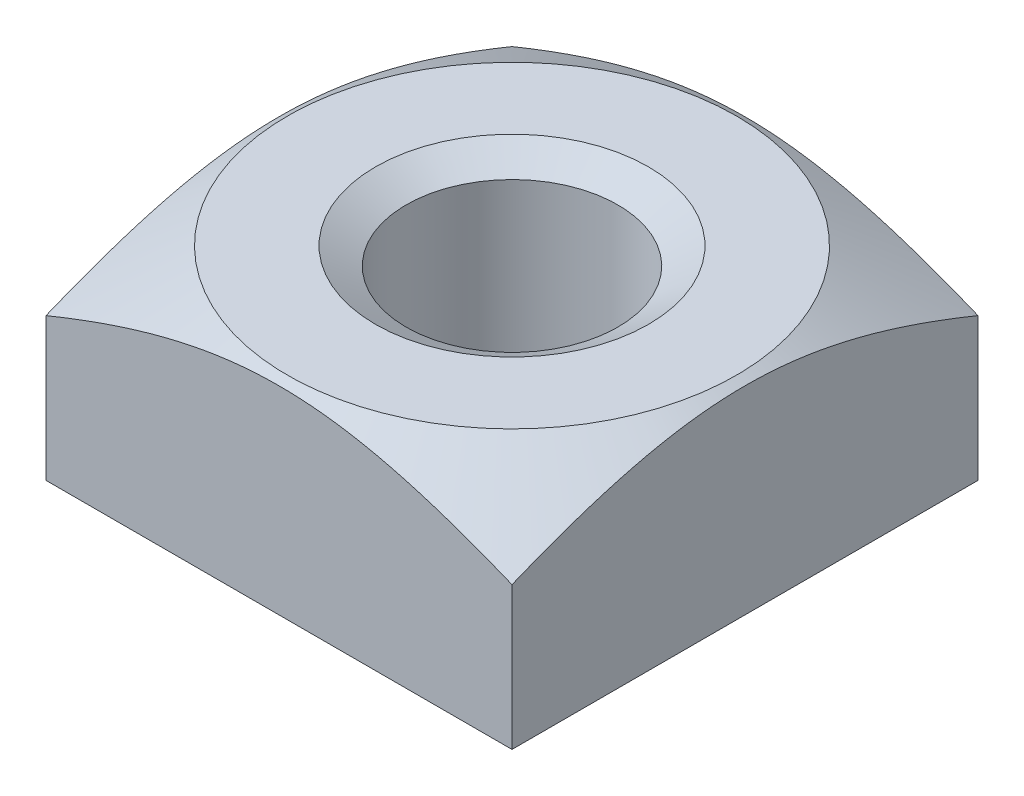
ISO-10303-21;
HEADER;
FILE_DESCRIPTION(('STEP AP214'),'2;1');
FILE_NAME('part.step','',(''),(''),'','','');
FILE_SCHEMA(('AUTOMOTIVE_DESIGN { 1 0 10303 214 1 1 1 1 }'));
ENDSEC;
DATA;
#1=APPLICATION_CONTEXT('core data for automotive mechanical design processes');
#2=APPLICATION_PROTOCOL_DEFINITION('international standard','automotive_design',2000,#1);
#3=PRODUCT_CONTEXT('',#1,'mechanical');
#4=PRODUCT('Part','Part','',(#3));
#5=PRODUCT_RELATED_PRODUCT_CATEGORY('part','',(#4));
#6=PRODUCT_DEFINITION_FORMATION('','',#4);
#7=PRODUCT_DEFINITION_CONTEXT('part definition',#1,'design');
#8=PRODUCT_DEFINITION('design','',#6,#7);
#9=PRODUCT_DEFINITION_SHAPE('','',#8);
#10=(LENGTH_UNIT() NAMED_UNIT(*) SI_UNIT(.MILLI.,.METRE.));
#11=(NAMED_UNIT(*) PLANE_ANGLE_UNIT() SI_UNIT($,.RADIAN.));
#12=(NAMED_UNIT(*) SI_UNIT($,.STERADIAN.) SOLID_ANGLE_UNIT());
#13=UNCERTAINTY_MEASURE_WITH_UNIT(LENGTH_MEASURE(1.E-05),#10,'distance_accuracy_value','');
#14=(GEOMETRIC_REPRESENTATION_CONTEXT(3) GLOBAL_UNCERTAINTY_ASSIGNED_CONTEXT((#13)) GLOBAL_UNIT_ASSIGNED_CONTEXT((#10,
#11,#12)) REPRESENTATION_CONTEXT('',''));
#15=CARTESIAN_POINT('',(0.,0.,0.));
#16=DIRECTION('',(0.,0.,1.));
#17=DIRECTION('',(1.,0.,0.));
#18=AXIS2_PLACEMENT_3D('',#15,#16,#17);
#19=CARTESIAN_POINT('',(-2.75000000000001,0.,-2.75));
#20=DIRECTION('',(0.,1.,0.));
#21=DIRECTION('',(0.,0.,1.));
#22=AXIS2_PLACEMENT_3D('',#19,#20,#21);
#23=PLANE('',#22);
#24=CARTESIAN_POINT('',(0.,0.,0.));
#25=DIRECTION('',(0.,1.,0.));
#26=DIRECTION('',(0.,0.,1.));
#27=AXIS2_PLACEMENT_3D('',#24,#25,#26);
#28=CIRCLE('',#27,1.61084391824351);
#29=CARTESIAN_POINT('',(0.,0.,1.61084391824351));
#30=VERTEX_POINT('',#29);
#31=EDGE_CURVE('E107',#30,#30,#28,.T.);
#32=ORIENTED_EDGE('',*,*,#31,.T.);
#33=EDGE_LOOP('',(#32));
#34=FACE_BOUND('',#33,.T.);
#35=DIRECTION('',(0.,0.,1.));
#36=VECTOR('',#35,1.);
#37=CARTESIAN_POINT('',(-2.75000000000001,0.,-2.75));
#38=LINE('',#37,#36);
#39=CARTESIAN_POINT('',(-2.75000000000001,0.,-2.75));
#40=VERTEX_POINT('',#39);
#41=CARTESIAN_POINT('',(-2.75,0.,2.75));
#42=VERTEX_POINT('',#41);
#43=EDGE_CURVE('E95',#40,#42,#38,.T.);
#44=ORIENTED_EDGE('',*,*,#43,.F.);
#45=DIRECTION('',(-1.,0.,0.));
#46=VECTOR('',#45,1.);
#47=CARTESIAN_POINT('',(-2.75000000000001,0.,-2.75));
#48=LINE('',#47,#46);
#49=CARTESIAN_POINT('',(2.75,0.,-2.75));
#50=VERTEX_POINT('',#49);
#51=EDGE_CURVE('E97',#50,#40,#48,.T.);
#52=ORIENTED_EDGE('',*,*,#51,.F.);
#53=DIRECTION('',(0.,0.,-1.));
#54=VECTOR('',#53,1.);
#55=CARTESIAN_POINT('',(2.75,0.,-2.75));
#56=LINE('',#55,#54);
#57=CARTESIAN_POINT('',(2.75000000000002,0.,2.75));
#58=VERTEX_POINT('',#57);
#59=EDGE_CURVE('E101',#58,#50,#56,.T.);
#60=ORIENTED_EDGE('',*,*,#59,.F.);
#61=DIRECTION('',(1.,0.,0.));
#62=VECTOR('',#61,1.);
#63=CARTESIAN_POINT('',(-2.75,0.,2.75));
#64=LINE('',#63,#62);
#65=EDGE_CURVE('E134',#42,#58,#64,.T.);
#66=ORIENTED_EDGE('',*,*,#65,.F.);
#67=EDGE_LOOP('',(#44,#52,#60,#66));
#68=FACE_BOUND('',#67,.T.);
#69=ADVANCED_FACE('F41',(#34,#68),#23,.F.);
#70=CARTESIAN_POINT('',(-2.75000000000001,2.4,-2.75));
#71=DIRECTION('',(0.,1.,0.));
#72=DIRECTION('',(0.,0.,1.));
#73=AXIS2_PLACEMENT_3D('',#70,#71,#72);
#74=PLANE('',#73);
#75=CARTESIAN_POINT('',(0.,2.4,0.));
#76=DIRECTION('',(0.,1.,0.));
#77=DIRECTION('',(0.,0.,1.));
#78=AXIS2_PLACEMENT_3D('',#75,#76,#77);
#79=CIRCLE('',#78,1.61084391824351);
#80=CARTESIAN_POINT('',(0.,2.4,1.61084391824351));
#81=VERTEX_POINT('',#80);
#82=EDGE_CURVE('E11',#81,#81,#79,.F.);
#83=ORIENTED_EDGE('',*,*,#82,.T.);
#84=EDGE_LOOP('',(#83));
#85=FACE_BOUND('',#84,.T.);
#86=CARTESIAN_POINT('',(0.,2.4,0.));
#87=DIRECTION('',(0.,-1.,0.));
#88=DIRECTION('',(0.,0.,-1.));
#89=AXIS2_PLACEMENT_3D('',#86,#87,#88);
#90=CIRCLE('',#89,2.65);
#91=CARTESIAN_POINT('',(0.,2.4,-2.65));
#92=VERTEX_POINT('',#91);
#93=EDGE_CURVE('E89',#92,#92,#90,.T.);
#94=ORIENTED_EDGE('',*,*,#93,.F.);
#95=EDGE_LOOP('',(#94));
#96=FACE_BOUND('',#95,.T.);
#97=ADVANCED_FACE('F127',(#85,#96),#74,.T.);
#98=CARTESIAN_POINT('',(-2.75000000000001,2.4,-2.75));
#99=DIRECTION('',(1.,0.,0.));
#100=DIRECTION('',(0.,0.,-1.));
#101=AXIS2_PLACEMENT_3D('',#98,#99,#100);
#102=PLANE('',#101);
#103=DIRECTION('',(0.,-1.,0.));
#104=VECTOR('',#103,1.);
#105=CARTESIAN_POINT('',(-2.75,2.4,2.75));
#106=LINE('',#105,#104);
#107=CARTESIAN_POINT('',(-2.75,1.68461261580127,2.75));
#108=VERTEX_POINT('',#107);
#109=EDGE_CURVE('E91',#108,#42,#106,.T.);
#110=ORIENTED_EDGE('',*,*,#109,.F.);
#111=CARTESIAN_POINT('',(-2.75000000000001,0.380255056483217,-5.49900931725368));
#112=CARTESIAN_POINT('',(-2.75000000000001,0.44952431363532,-5.36484458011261));
#113=CARTESIAN_POINT('',(-2.75000000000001,0.518409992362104,-5.23047988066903));
#114=CARTESIAN_POINT('',(-2.75000000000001,0.655209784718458,-4.96124683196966));
#115=CARTESIAN_POINT('',(-2.75000000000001,0.723123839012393,-4.82637845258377));
#116=CARTESIAN_POINT('',(-2.75000000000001,0.857919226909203,-4.55574598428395));
#117=CARTESIAN_POINT('',(-2.75000000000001,0.924797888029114,-4.41998056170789));
#118=CARTESIAN_POINT('',(-2.75000000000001,1.05707230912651,-4.14773168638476));
#119=CARTESIAN_POINT('',(-2.75000000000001,1.12246810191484,-4.01124824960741));
#120=CARTESIAN_POINT('',(-2.75000000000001,1.25502698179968,-3.72969277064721));
#121=CARTESIAN_POINT('',(-2.75000000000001,1.32208227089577,-3.58456981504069));
#122=CARTESIAN_POINT('',(-2.75000000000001,1.4535024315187,-3.29311202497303));
#123=CARTESIAN_POINT('',(-2.75000000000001,1.51786739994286,-3.14677723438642));
#124=CARTESIAN_POINT('',(-2.75000000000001,1.64301596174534,-2.85271132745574));
#125=CARTESIAN_POINT('',(-2.75000000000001,1.70380233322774,-2.70498140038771));
#126=CARTESIAN_POINT('',(-2.75000000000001,1.82066788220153,-2.40768151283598));
#127=CARTESIAN_POINT('',(-2.75000000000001,1.87674778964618,-2.25811184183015));
#128=CARTESIAN_POINT('',(-2.75000000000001,1.9819872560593,-1.95844118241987));
#129=CARTESIAN_POINT('',(-2.75,2.03121827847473,-1.80836559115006));
#130=CARTESIAN_POINT('',(-2.75,2.12140294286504,-1.50569581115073));
#131=CARTESIAN_POINT('',(-2.75,2.16235632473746,-1.35310154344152));
#132=CARTESIAN_POINT('',(-2.75,2.23267563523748,-1.04837997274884));
#133=CARTESIAN_POINT('',(-2.75,2.26225416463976,-0.896302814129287));
#134=CARTESIAN_POINT('',(-2.75,2.308350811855,-0.590135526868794));
#135=CARTESIAN_POINT('',(-2.75,2.32487220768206,-0.436045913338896));
#136=CARTESIAN_POINT('',(-2.75,2.33951701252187,-0.187227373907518));
#137=CARTESIAN_POINT('',(-2.75,2.34230025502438,-0.0927575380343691));
#138=CARTESIAN_POINT('',(-2.75,2.34222907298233,0.096189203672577));
#139=CARTESIAN_POINT('',(-2.75,2.33937443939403,0.190666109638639));
#140=CARTESIAN_POINT('',(-2.75,2.32814990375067,0.379305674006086));
#141=CARTESIAN_POINT('',(-2.75,2.31977884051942,0.47346826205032));
#142=CARTESIAN_POINT('',(-2.75,2.29788190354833,0.661187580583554));
#143=CARTESIAN_POINT('',(-2.75,2.28435586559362,0.754744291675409));
#144=CARTESIAN_POINT('',(-2.75,2.25221941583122,0.943664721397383));
#145=CARTESIAN_POINT('',(-2.75,2.23347741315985,1.03900582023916));
#146=CARTESIAN_POINT('',(-2.75,2.19172168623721,1.22874057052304));
#147=CARTESIAN_POINT('',(-2.75,2.16870785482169,1.323134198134));
#148=CARTESIAN_POINT('',(-2.75,2.11902722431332,1.51099636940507));
#149=CARTESIAN_POINT('',(-2.75,2.09235866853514,1.60446444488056));
#150=CARTESIAN_POINT('',(-2.75,2.03595405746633,1.79045737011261));
#151=CARTESIAN_POINT('',(-2.75,2.00621817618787,1.88298227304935));
#152=CARTESIAN_POINT('',(-2.75,1.9184204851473,2.1436904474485));
#153=CARTESIAN_POINT('',(-2.75,1.85735199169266,2.3108601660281));
#154=CARTESIAN_POINT('',(-2.75,1.72907502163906,2.64284157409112));
#155=CARTESIAN_POINT('',(-2.75,1.66186478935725,2.80765257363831));
#156=CARTESIAN_POINT('',(-2.75,1.52292772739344,3.13553451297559));
#157=CARTESIAN_POINT('',(-2.75,1.4511966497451,3.29860364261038));
#158=CARTESIAN_POINT('',(-2.75,1.30445507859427,3.62322988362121));
#159=CARTESIAN_POINT('',(-2.75,1.2294449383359,3.78478715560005));
#160=CARTESIAN_POINT('',(-2.75,1.07670556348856,4.10725192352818));
#161=CARTESIAN_POINT('',(-2.75,0.998968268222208,4.26815558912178));
#162=CARTESIAN_POINT('',(-2.75,0.84158363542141,4.58902750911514));
#163=CARTESIAN_POINT('',(-2.75,0.761936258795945,4.74899574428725));
#164=CARTESIAN_POINT('',(-2.75,0.520877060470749,5.2276119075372));
#165=CARTESIAN_POINT('',(-2.75,0.357262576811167,5.54514932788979));
#166=CARTESIAN_POINT('',(-2.75,0.048630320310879,6.13558599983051));
#167=CARTESIAN_POINT('',(-2.75,-0.0959203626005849,6.40873107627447));
#168=CARTESIAN_POINT('',(-2.75,-0.387035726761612,6.95399947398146));
#169=CARTESIAN_POINT('',(-2.75,-0.533600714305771,7.22612263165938));
#170=CARTESIAN_POINT('',(-2.75,-0.827192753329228,7.76776565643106));
#171=CARTESIAN_POINT('',(-2.75,-0.974210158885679,8.03729076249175));
#172=CARTESIAN_POINT('',(-2.75,-1.26931753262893,8.57569133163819));
#173=CARTESIAN_POINT('',(-2.75,-1.4174073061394,8.84456690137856));
#174=CARTESIAN_POINT('',(-2.75,-1.56588176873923,9.1132283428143));
#175=B_SPLINE_CURVE_WITH_KNOTS('',3,(#111,#112,#113,#114,#115,#116,#117,#118,#119,#120,#121,
#122,#123,#124,#125,#126,#127,#128,#129,#130,#131,#132,#133,#134,#135,#136,#137,#138,#139,#140,
#141,#142,#143,#144,#145,#146,#147,#148,#149,#150,#151,#152,#153,#154,#155,#156,#157,#158,#159,
#160,#161,#162,#163,#164,#165,#166,#167,#168,#169,#170,#171,#172,#173,#174),.UNSPECIFIED.,.F.,
.F.,(4,2,2,2,2,2,2,2,2,2,2,2,2,2,2,2,2,2,2,2,2,2,2,2,2,2,2,2,2,2,2,4),(0.,0.452976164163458,
0.905979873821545,1.36000454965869,1.81401916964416,2.29359580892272,2.77315516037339,
3.25233717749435,3.73144473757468,4.20510238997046,4.67877492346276,5.14310558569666,
5.60731963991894,5.8906985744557,6.17408801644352,6.45753712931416,6.74099527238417,
7.03237929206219,7.32377062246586,7.61530250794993,7.90681786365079,8.44055100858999,
8.97443720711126,9.50883276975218,10.043170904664,10.5792494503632,11.1153389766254,
12.1869255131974,13.1140251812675,14.0412674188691,14.9623083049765,15.8831859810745),.UNSPECIFIED.);
#176=CARTESIAN_POINT('',(-2.75000000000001,1.68461261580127,-2.75));
#177=VERTEX_POINT('',#176);
#178=EDGE_CURVE('E84',#108,#177,#175,.F.);
#179=ORIENTED_EDGE('',*,*,#178,.T.);
#180=DIRECTION('',(0.,-1.,0.));
#181=VECTOR('',#180,1.);
#182=CARTESIAN_POINT('',(-2.75000000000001,2.4,-2.75));
#183=LINE('',#182,#181);
#184=EDGE_CURVE('E63',#177,#40,#183,.T.);
#185=ORIENTED_EDGE('',*,*,#184,.T.);
#186=ORIENTED_EDGE('',*,*,#43,.T.);
#187=EDGE_LOOP('',(#110,#179,#185,#186));
#188=FACE_BOUND('',#187,.T.);
#189=ADVANCED_FACE('F86',(#188),#102,.F.);
#190=CARTESIAN_POINT('',(-2.75,2.4,2.75));
#191=DIRECTION('',(0.,0.,-1.));
#192=DIRECTION('',(-1.,0.,0.));
#193=AXIS2_PLACEMENT_3D('',#190,#191,#192);
#194=PLANE('',#193);
#195=DIRECTION('',(0.,-1.,0.));
#196=VECTOR('',#195,1.);
#197=CARTESIAN_POINT('',(2.75000000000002,2.4,2.75));
#198=LINE('',#197,#196);
#199=CARTESIAN_POINT('',(2.75000000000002,1.68461261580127,2.75));
#200=VERTEX_POINT('',#199);
#201=EDGE_CURVE('E103',#200,#58,#198,.T.);
#202=ORIENTED_EDGE('',*,*,#201,.F.);
#203=CARTESIAN_POINT('',(-5.49900931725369,0.380255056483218,2.75));
#204=CARTESIAN_POINT('',(-5.36484458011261,0.449524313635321,2.75));
#205=CARTESIAN_POINT('',(-5.23047988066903,0.518409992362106,2.75));
#206=CARTESIAN_POINT('',(-4.96124683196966,0.655209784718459,2.75));
#207=CARTESIAN_POINT('',(-4.82637845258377,0.723123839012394,2.75));
#208=CARTESIAN_POINT('',(-4.55574598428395,0.857919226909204,2.75));
#209=CARTESIAN_POINT('',(-4.41998056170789,0.924797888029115,2.75));
#210=CARTESIAN_POINT('',(-4.14773168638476,1.05707230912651,2.75));
#211=CARTESIAN_POINT('',(-4.01124824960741,1.12246810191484,2.75));
#212=CARTESIAN_POINT('',(-3.72969277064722,1.25502698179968,2.75));
#213=CARTESIAN_POINT('',(-3.58456981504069,1.32208227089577,2.75));
#214=CARTESIAN_POINT('',(-3.29311202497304,1.4535024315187,2.75));
#215=CARTESIAN_POINT('',(-3.14677723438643,1.51786739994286,2.75));
#216=CARTESIAN_POINT('',(-2.85271132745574,1.64301596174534,2.75));
#217=CARTESIAN_POINT('',(-2.70498140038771,1.70380233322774,2.75));
#218=CARTESIAN_POINT('',(-2.40768151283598,1.82066788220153,2.75));
#219=CARTESIAN_POINT('',(-2.25811184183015,1.87674778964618,2.75));
#220=CARTESIAN_POINT('',(-1.95844118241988,1.9819872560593,2.75));
#221=CARTESIAN_POINT('',(-1.80836559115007,2.03121827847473,2.75));
#222=CARTESIAN_POINT('',(-1.50569581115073,2.12140294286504,2.75));
#223=CARTESIAN_POINT('',(-1.35310154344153,2.16235632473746,2.75));
#224=CARTESIAN_POINT('',(-1.04837997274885,2.23267563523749,2.75));
#225=CARTESIAN_POINT('',(-0.896302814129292,2.26225416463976,2.75));
#226=CARTESIAN_POINT('',(-0.5901355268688,2.30835081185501,2.75));
#227=CARTESIAN_POINT('',(-0.436045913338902,2.32487220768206,2.75));
#228=CARTESIAN_POINT('',(-0.187227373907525,2.33951701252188,2.75));
#229=CARTESIAN_POINT('',(-0.0927575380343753,2.34230025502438,2.75));
#230=CARTESIAN_POINT('',(0.096189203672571,2.34222907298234,2.75));
#231=CARTESIAN_POINT('',(0.190666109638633,2.33937443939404,2.75));
#232=CARTESIAN_POINT('',(0.37930567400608,2.32814990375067,2.75));
#233=CARTESIAN_POINT('',(0.473468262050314,2.31977884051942,2.75));
#234=CARTESIAN_POINT('',(0.661187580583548,2.29788190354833,2.75));
#235=CARTESIAN_POINT('',(0.754744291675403,2.28435586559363,2.75));
#236=CARTESIAN_POINT('',(0.943664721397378,2.25221941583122,2.75));
#237=CARTESIAN_POINT('',(1.03900582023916,2.23347741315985,2.75));
#238=CARTESIAN_POINT('',(1.22874057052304,2.19172168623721,2.75));
#239=CARTESIAN_POINT('',(1.32313419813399,2.16870785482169,2.75));
#240=CARTESIAN_POINT('',(1.51099636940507,2.11902722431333,2.75));
#241=CARTESIAN_POINT('',(1.60446444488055,2.09235866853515,2.75));
#242=CARTESIAN_POINT('',(1.79045737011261,2.03595405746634,2.75));
#243=CARTESIAN_POINT('',(1.88298227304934,2.00621817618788,2.75));
#244=CARTESIAN_POINT('',(2.14369044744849,1.91842048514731,2.75));
#245=CARTESIAN_POINT('',(2.3108601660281,1.85735199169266,2.75));
#246=CARTESIAN_POINT('',(2.64284157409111,1.72907502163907,2.75));
#247=CARTESIAN_POINT('',(2.8076525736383,1.66186478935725,2.75));
#248=CARTESIAN_POINT('',(3.13553451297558,1.52292772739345,2.75));
#249=CARTESIAN_POINT('',(3.29860364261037,1.4511966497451,2.75));
#250=CARTESIAN_POINT('',(3.6232298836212,1.30445507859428,2.75));
#251=CARTESIAN_POINT('',(3.78478715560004,1.2294449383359,2.75));
#252=CARTESIAN_POINT('',(4.10725192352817,1.07670556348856,2.75));
#253=CARTESIAN_POINT('',(4.26815558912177,0.998968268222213,2.75));
#254=CARTESIAN_POINT('',(4.58902750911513,0.841583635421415,2.75));
#255=CARTESIAN_POINT('',(4.74899574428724,0.76193625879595,2.75));
#256=CARTESIAN_POINT('',(5.22761190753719,0.520877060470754,2.75));
#257=CARTESIAN_POINT('',(5.54514932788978,0.357262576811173,2.75));
#258=CARTESIAN_POINT('',(6.13558599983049,0.0486303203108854,2.75));
#259=CARTESIAN_POINT('',(6.40873107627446,-0.0959203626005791,2.75));
#260=CARTESIAN_POINT('',(6.95399947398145,-0.387035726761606,2.75));
#261=CARTESIAN_POINT('',(7.22612263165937,-0.533600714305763,2.75));
#262=CARTESIAN_POINT('',(7.76776565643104,-0.827192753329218,2.75));
#263=CARTESIAN_POINT('',(8.03729076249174,-0.97421015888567,2.75));
#264=CARTESIAN_POINT('',(8.57569133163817,-1.26931753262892,2.75));
#265=CARTESIAN_POINT('',(8.84456690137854,-1.41740730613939,2.75));
#266=CARTESIAN_POINT('',(9.11322834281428,-1.56588176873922,2.75));
#267=B_SPLINE_CURVE_WITH_KNOTS('',3,(#203,#204,#205,#206,#207,#208,#209,#210,#211,#212,#213,
#214,#215,#216,#217,#218,#219,#220,#221,#222,#223,#224,#225,#226,#227,#228,#229,#230,#231,#232,
#233,#234,#235,#236,#237,#238,#239,#240,#241,#242,#243,#244,#245,#246,#247,#248,#249,#250,#251,
#252,#253,#254,#255,#256,#257,#258,#259,#260,#261,#262,#263,#264,#265,#266),.UNSPECIFIED.,.F.,
.F.,(4,2,2,2,2,2,2,2,2,2,2,2,2,2,2,2,2,2,2,2,2,2,2,2,2,2,2,2,2,2,2,4),(0.,0.452976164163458,
0.905979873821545,1.36000454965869,1.81401916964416,2.29359580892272,2.77315516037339,
3.25233717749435,3.73144473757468,4.20510238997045,4.67877492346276,5.14310558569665,
5.60731963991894,5.89069857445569,6.17408801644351,6.45753712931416,6.74099527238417,
7.03237929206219,7.32377062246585,7.61530250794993,7.90681786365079,8.44055100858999,
8.97443720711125,9.50883276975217,10.043170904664,10.5792494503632,11.1153389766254,
12.1869255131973,13.1140251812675,14.0412674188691,14.9623083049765,15.8831859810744),.UNSPECIFIED.);
#268=EDGE_CURVE('E92',#200,#108,#267,.F.);
#269=ORIENTED_EDGE('',*,*,#268,.T.);
#270=ORIENTED_EDGE('',*,*,#109,.T.);
#271=ORIENTED_EDGE('',*,*,#65,.T.);
#272=EDGE_LOOP('',(#202,#269,#270,#271));
#273=FACE_BOUND('',#272,.T.);
#274=ADVANCED_FACE('F147',(#273),#194,.F.);
#275=CARTESIAN_POINT('',(2.75,2.4,-2.75));
#276=DIRECTION('',(-1.,0.,0.));
#277=DIRECTION('',(0.,0.,1.));
#278=AXIS2_PLACEMENT_3D('',#275,#276,#277);
#279=PLANE('',#278);
#280=DIRECTION('',(0.,-1.,0.));
#281=VECTOR('',#280,1.);
#282=CARTESIAN_POINT('',(2.75,2.4,-2.75));
#283=LINE('',#282,#281);
#284=CARTESIAN_POINT('',(2.75,1.68461261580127,-2.75));
#285=VERTEX_POINT('',#284);
#286=EDGE_CURVE('E100',#285,#50,#283,.T.);
#287=ORIENTED_EDGE('',*,*,#286,.F.);
#288=CARTESIAN_POINT('',(2.74999999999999,0.380255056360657,-5.49900931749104));
#289=CARTESIAN_POINT('',(2.74999999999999,0.449524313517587,-5.36484458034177));
#290=CARTESIAN_POINT('',(2.74999999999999,0.518409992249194,-5.23047988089));
#291=CARTESIAN_POINT('',(2.74999999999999,0.65520978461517,-4.96124683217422));
#292=CARTESIAN_POINT('',(2.74999999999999,0.723123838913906,-4.82637845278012));
#293=CARTESIAN_POINT('',(2.74999999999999,0.857919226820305,-4.55574598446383));
#294=CARTESIAN_POINT('',(2.74999999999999,0.924797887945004,-4.4199805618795));
#295=CARTESIAN_POINT('',(2.74999999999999,1.05707230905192,-4.1477316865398));
#296=CARTESIAN_POINT('',(2.75,1.12246810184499,-4.01124824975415));
#297=CARTESIAN_POINT('',(2.75,1.25502698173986,-3.72969277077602));
#298=CARTESIAN_POINT('',(2.75,1.32208227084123,-3.58456981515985));
#299=CARTESIAN_POINT('',(2.75,1.45350243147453,-3.29311202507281));
#300=CARTESIAN_POINT('',(2.75,1.51786739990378,-3.14677723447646));
#301=CARTESIAN_POINT('',(2.75,1.64301596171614,-2.85271132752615));
#302=CARTESIAN_POINT('',(2.75,1.70380233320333,-2.70498140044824));
#303=CARTESIAN_POINT('',(2.75,1.82066788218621,-2.40768151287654));
#304=CARTESIAN_POINT('',(2.75,1.87674778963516,-2.25811184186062));
#305=CARTESIAN_POINT('',(2.75,1.98198725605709,-1.95844118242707));
#306=CARTESIAN_POINT('',(2.75,2.03121827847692,-1.80836559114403));
#307=CARTESIAN_POINT('',(2.75,2.12140294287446,-1.50569581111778));
#308=CARTESIAN_POINT('',(2.75,2.16235632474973,-1.35310154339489));
#309=CARTESIAN_POINT('',(2.75,2.23267563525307,-1.04837997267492));
#310=CARTESIAN_POINT('',(2.75,2.26225416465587,-0.896302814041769));
#311=CARTESIAN_POINT('',(2.75000000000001,2.30835081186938,-0.590135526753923));
#312=CARTESIAN_POINT('',(2.75000000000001,2.32487220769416,-0.436045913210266));
#313=CARTESIAN_POINT('',(2.75000000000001,2.33951701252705,-0.187227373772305));
#314=CARTESIAN_POINT('',(2.75000000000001,2.34230025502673,-0.0927575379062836));
#315=CARTESIAN_POINT('',(2.75000000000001,2.34222907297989,0.0961892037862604));
#316=CARTESIAN_POINT('',(2.75000000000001,2.33937443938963,0.190666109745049));
#317=CARTESIAN_POINT('',(2.75000000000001,2.32814990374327,0.379305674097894));
#318=CARTESIAN_POINT('',(2.75000000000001,2.31977884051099,0.4734682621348));
#319=CARTESIAN_POINT('',(2.75000000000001,2.29788190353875,0.661187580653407));
#320=CARTESIAN_POINT('',(2.75000000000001,2.28435586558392,0.754744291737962));
#321=CARTESIAN_POINT('',(2.75000000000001,2.25221941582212,0.943664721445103));
#322=CARTESIAN_POINT('',(2.75000000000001,2.23347741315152,1.03900582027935));
#323=CARTESIAN_POINT('',(2.75000000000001,2.19172168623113,1.22874057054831));
#324=CARTESIAN_POINT('',(2.75000000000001,2.16870785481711,1.32313419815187));
#325=CARTESIAN_POINT('',(2.75000000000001,2.11902722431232,1.51099636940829));
#326=CARTESIAN_POINT('',(2.75000000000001,2.09235866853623,1.6044644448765));
#327=CARTESIAN_POINT('',(2.75000000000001,2.03595405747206,1.79045737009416));
#328=CARTESIAN_POINT('',(2.75000000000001,2.00621817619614,1.88298227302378));
#329=CARTESIAN_POINT('',(2.75000000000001,1.91842048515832,2.1436904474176));
#330=CARTESIAN_POINT('',(2.75000000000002,1.85735199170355,2.3108601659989));
#331=CARTESIAN_POINT('',(2.75000000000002,1.72907502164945,2.64284157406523));
#332=CARTESIAN_POINT('',(2.75000000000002,1.66186478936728,2.80765257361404));
#333=CARTESIAN_POINT('',(2.75000000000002,1.52292772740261,3.13553451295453));
#334=CARTESIAN_POINT('',(2.75000000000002,1.45119664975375,3.2986036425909));
#335=CARTESIAN_POINT('',(2.75000000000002,1.30445507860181,3.62322988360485));
#336=CARTESIAN_POINT('',(2.75000000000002,1.22944493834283,3.78478715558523));
#337=CARTESIAN_POINT('',(2.75000000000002,1.07670556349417,4.10725192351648));
#338=CARTESIAN_POINT('',(2.75000000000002,0.998968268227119,4.26815558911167));
#339=CARTESIAN_POINT('',(2.75000000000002,0.841583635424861,4.58902750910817));
#340=CARTESIAN_POINT('',(2.75000000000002,0.761936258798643,4.74899574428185));
#341=CARTESIAN_POINT('',(2.75000000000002,0.520877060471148,5.22761190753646));
#342=CARTESIAN_POINT('',(2.75000000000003,0.357262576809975,5.54514932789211));
#343=CARTESIAN_POINT('',(2.75000000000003,0.0486303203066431,6.13558599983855));
#344=CARTESIAN_POINT('',(2.75000000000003,-0.0959203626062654,6.40873107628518));
#345=CARTESIAN_POINT('',(2.75000000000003,-0.387035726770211,6.95399947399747));
#346=CARTESIAN_POINT('',(2.75000000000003,-0.533600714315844,7.22612263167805));
#347=CARTESIAN_POINT('',(2.75000000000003,-0.827192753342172,7.76776565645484));
#348=CARTESIAN_POINT('',(2.75000000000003,-0.974210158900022,8.037290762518));
#349=CARTESIAN_POINT('',(2.75000000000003,-1.26931753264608,8.57569133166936));
#350=CARTESIAN_POINT('',(2.75000000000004,-1.41740730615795,8.84456690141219));
#351=CARTESIAN_POINT('',(2.75000000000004,-1.56588176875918,9.1132283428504));
#352=B_SPLINE_CURVE_WITH_KNOTS('',3,(#288,#289,#290,#291,#292,#293,#294,#295,#296,#297,#298,
#299,#300,#301,#302,#303,#304,#305,#306,#307,#308,#309,#310,#311,#312,#313,#314,#315,#316,#317,
#318,#319,#320,#321,#322,#323,#324,#325,#326,#327,#328,#329,#330,#331,#332,#333,#334,#335,#336,
#337,#338,#339,#340,#341,#342,#343,#344,#345,#346,#347,#348,#349,#350,#351),.UNSPECIFIED.,.F.,
.F.,(4,2,2,2,2,2,2,2,2,2,2,2,2,2,2,2,2,2,2,2,2,2,2,2,2,2,2,2,2,2,2,4),(0.,0.452976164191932,
0.905979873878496,1.36000454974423,1.8140191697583,2.29359580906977,2.77315516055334,
3.25233717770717,3.73144473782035,4.2051023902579,4.67877492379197,5.14310558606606,
5.60731964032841,5.89069857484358,6.17408801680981,6.45753712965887,6.7409952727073,
7.03237929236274,7.32377062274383,7.61530250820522,7.90681786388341,8.44055100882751,
8.97443720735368,9.50883276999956,10.0431709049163,10.5792494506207,11.1153389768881,
12.1869255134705,13.1140251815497,14.0412674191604,14.9623083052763,15.8831859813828),.UNSPECIFIED.);
#353=EDGE_CURVE('E57',#285,#200,#352,.T.);
#354=ORIENTED_EDGE('',*,*,#353,.T.);
#355=ORIENTED_EDGE('',*,*,#201,.T.);
#356=ORIENTED_EDGE('',*,*,#59,.T.);
#357=EDGE_LOOP('',(#287,#354,#355,#356));
#358=FACE_BOUND('',#357,.T.);
#359=ADVANCED_FACE('F144',(#358),#279,.F.);
#360=CARTESIAN_POINT('',(-2.75000000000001,2.4,-2.75));
#361=DIRECTION('',(0.,0.,1.));
#362=DIRECTION('',(1.,0.,0.));
#363=AXIS2_PLACEMENT_3D('',#360,#361,#362);
#364=PLANE('',#363);
#365=ORIENTED_EDGE('',*,*,#184,.F.);
#366=CARTESIAN_POINT('',(-5.49900931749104,0.380255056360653,-2.74999999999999));
#367=CARTESIAN_POINT('',(-5.36484458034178,0.449524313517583,-2.74999999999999));
#368=CARTESIAN_POINT('',(-5.23047988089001,0.51840999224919,-2.74999999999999));
#369=CARTESIAN_POINT('',(-4.96124683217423,0.655209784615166,-2.74999999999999));
#370=CARTESIAN_POINT('',(-4.82637845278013,0.723123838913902,-2.74999999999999));
#371=CARTESIAN_POINT('',(-4.55574598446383,0.857919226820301,-2.74999999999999));
#372=CARTESIAN_POINT('',(-4.4199805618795,0.924797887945,-2.74999999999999));
#373=CARTESIAN_POINT('',(-4.14773168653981,1.05707230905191,-2.74999999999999));
#374=CARTESIAN_POINT('',(-4.01124824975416,1.12246810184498,-2.74999999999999));
#375=CARTESIAN_POINT('',(-3.72969277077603,1.25502698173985,-2.74999999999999));
#376=CARTESIAN_POINT('',(-3.58456981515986,1.32208227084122,-2.75));
#377=CARTESIAN_POINT('',(-3.29311202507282,1.45350243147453,-2.75));
#378=CARTESIAN_POINT('',(-3.14677723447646,1.51786739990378,-2.75));
#379=CARTESIAN_POINT('',(-2.85271132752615,1.64301596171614,-2.75));
#380=CARTESIAN_POINT('',(-2.70498140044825,1.70380233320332,-2.75));
#381=CARTESIAN_POINT('',(-2.40768151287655,1.82066788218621,-2.75));
#382=CARTESIAN_POINT('',(-2.25811184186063,1.87674778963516,-2.75));
#383=CARTESIAN_POINT('',(-1.95844118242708,1.98198725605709,-2.75));
#384=CARTESIAN_POINT('',(-1.80836559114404,2.03121827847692,-2.75));
#385=CARTESIAN_POINT('',(-1.50569581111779,2.12140294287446,-2.75));
#386=CARTESIAN_POINT('',(-1.3531015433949,2.16235632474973,-2.75));
#387=CARTESIAN_POINT('',(-1.04837997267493,2.23267563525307,-2.75));
#388=CARTESIAN_POINT('',(-0.896302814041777,2.26225416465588,-2.75));
#389=CARTESIAN_POINT('',(-0.590135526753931,2.30835081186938,-2.75));
#390=CARTESIAN_POINT('',(-0.436045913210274,2.32487220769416,-2.75));
#391=CARTESIAN_POINT('',(-0.187227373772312,2.33951701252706,-2.75));
#392=CARTESIAN_POINT('',(-0.0927575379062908,2.34230025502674,-2.75));
#393=CARTESIAN_POINT('',(0.0961892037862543,2.3422290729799,-2.75));
#394=CARTESIAN_POINT('',(0.190666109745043,2.33937443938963,-2.75));
#395=CARTESIAN_POINT('',(0.379305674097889,2.32814990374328,-2.75));
#396=CARTESIAN_POINT('',(0.473468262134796,2.31977884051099,-2.75));
#397=CARTESIAN_POINT('',(0.661187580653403,2.29788190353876,-2.75));
#398=CARTESIAN_POINT('',(0.754744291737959,2.28435586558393,-2.75));
#399=CARTESIAN_POINT('',(0.9436647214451,2.25221941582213,-2.75));
#400=CARTESIAN_POINT('',(1.03900582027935,2.23347741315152,-2.75));
#401=CARTESIAN_POINT('',(1.22874057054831,2.19172168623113,-2.75));
#402=CARTESIAN_POINT('',(1.32313419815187,2.16870785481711,-2.75));
#403=CARTESIAN_POINT('',(1.51099636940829,2.11902722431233,-2.75));
#404=CARTESIAN_POINT('',(1.6044644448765,2.09235866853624,-2.75));
#405=CARTESIAN_POINT('',(1.79045737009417,2.03595405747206,-2.75));
#406=CARTESIAN_POINT('',(1.88298227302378,2.00621817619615,-2.75));
#407=CARTESIAN_POINT('',(2.1436904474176,1.91842048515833,-2.75));
#408=CARTESIAN_POINT('',(2.3108601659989,1.85735199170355,-2.75));
#409=CARTESIAN_POINT('',(2.64284157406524,1.72907502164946,-2.75));
#410=CARTESIAN_POINT('',(2.80765257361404,1.66186478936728,-2.75));
#411=CARTESIAN_POINT('',(3.13553451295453,1.52292772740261,-2.75));
#412=CARTESIAN_POINT('',(3.2986036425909,1.45119664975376,-2.75));
#413=CARTESIAN_POINT('',(3.62322988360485,1.30445507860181,-2.75));
#414=CARTESIAN_POINT('',(3.78478715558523,1.22944493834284,-2.75));
#415=CARTESIAN_POINT('',(4.10725192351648,1.07670556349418,-2.75));
#416=CARTESIAN_POINT('',(4.26815558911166,0.998968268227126,-2.75));
#417=CARTESIAN_POINT('',(4.58902750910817,0.841583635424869,-2.75));
#418=CARTESIAN_POINT('',(4.74899574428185,0.761936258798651,-2.75));
#419=CARTESIAN_POINT('',(5.22761190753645,0.520877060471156,-2.75));
#420=CARTESIAN_POINT('',(5.54514932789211,0.357262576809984,-2.75));
#421=CARTESIAN_POINT('',(6.13558599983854,0.0486303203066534,-2.75));
#422=CARTESIAN_POINT('',(6.40873107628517,-0.0959203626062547,-2.75));
#423=CARTESIAN_POINT('',(6.95399947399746,-0.387035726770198,-2.75));
#424=CARTESIAN_POINT('',(7.22612263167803,-0.533600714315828,-2.75));
#425=CARTESIAN_POINT('',(7.76776565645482,-0.827192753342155,-2.75));
#426=CARTESIAN_POINT('',(8.03729076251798,-0.974210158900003,-2.75));
#427=CARTESIAN_POINT('',(8.57569133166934,-1.26931753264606,-2.75));
#428=CARTESIAN_POINT('',(8.84456690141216,-1.41740730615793,-2.75));
#429=CARTESIAN_POINT('',(9.11322834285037,-1.56588176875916,-2.75));
#430=B_SPLINE_CURVE_WITH_KNOTS('',3,(#366,#367,#368,#369,#370,#371,#372,#373,#374,#375,#376,
#377,#378,#379,#380,#381,#382,#383,#384,#385,#386,#387,#388,#389,#390,#391,#392,#393,#394,#395,
#396,#397,#398,#399,#400,#401,#402,#403,#404,#405,#406,#407,#408,#409,#410,#411,#412,#413,#414,
#415,#416,#417,#418,#419,#420,#421,#422,#423,#424,#425,#426,#427,#428,#429),.UNSPECIFIED.,.F.,
.F.,(4,2,2,2,2,2,2,2,2,2,2,2,2,2,2,2,2,2,2,2,2,2,2,2,2,2,2,2,2,2,2,4),(0.,0.452976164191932,
0.905979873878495,1.36000454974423,1.8140191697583,2.29359580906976,2.77315516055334,
3.25233717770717,3.73144473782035,4.2051023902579,4.67877492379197,5.14310558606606,
5.60731964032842,5.89069857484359,6.17408801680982,6.45753712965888,6.74099527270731,
7.03237929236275,7.32377062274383,7.61530250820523,7.90681786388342,8.44055100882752,
8.9744372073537,9.50883276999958,10.0431709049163,10.5792494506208,11.1153389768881,
12.1869255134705,13.1140251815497,14.0412674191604,14.9623083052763,15.8831859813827),.UNSPECIFIED.);
#431=EDGE_CURVE('E81',#177,#285,#430,.T.);
#432=ORIENTED_EDGE('',*,*,#431,.T.);
#433=ORIENTED_EDGE('',*,*,#286,.T.);
#434=ORIENTED_EDGE('',*,*,#51,.T.);
#435=EDGE_LOOP('',(#365,#432,#433,#434));
#436=FACE_BOUND('',#435,.T.);
#437=ADVANCED_FACE('F94',(#436),#364,.F.);
#438=CARTESIAN_POINT('',(0.,2.4,0.));
#439=DIRECTION('',(0.,-1.,0.));
#440=DIRECTION('',(0.,0.,-1.));
#441=AXIS2_PLACEMENT_3D('',#438,#439,#440);
#442=CONICAL_SURFACE('',#441,2.65,1.0471975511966);
#443=ORIENTED_EDGE('',*,*,#93,.T.);
#444=EDGE_LOOP('',(#443));
#445=FACE_BOUND('',#444,.T.);
#446=ORIENTED_EDGE('',*,*,#268,.F.);
#447=ORIENTED_EDGE('',*,*,#353,.F.);
#448=ORIENTED_EDGE('',*,*,#431,.F.);
#449=ORIENTED_EDGE('',*,*,#178,.F.);
#450=EDGE_LOOP('',(#446,#447,#448,#449));
#451=FACE_BOUND('',#450,.T.);
#452=ADVANCED_FACE('F82',(#445,#451),#442,.T.);
#453=CARTESIAN_POINT('',(0.,2.4,0.));
#454=DIRECTION('',(0.,-1.,0.));
#455=DIRECTION('',(0.,0.,-1.));
#456=AXIS2_PLACEMENT_3D('',#453,#454,#455);
#457=CYLINDRICAL_SURFACE('',#456,1.25);
#458=CARTESIAN_POINT('',(0.,0.208333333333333,0.));
#459=DIRECTION('',(0.,1.,0.));
#460=DIRECTION('',(0.,0.,1.));
#461=AXIS2_PLACEMENT_3D('',#458,#459,#460);
#462=CIRCLE('',#461,1.25);
#463=CARTESIAN_POINT('',(0.,0.208333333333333,1.25));
#464=VERTEX_POINT('',#463);
#465=EDGE_CURVE('E47',#464,#464,#462,.F.);
#466=ORIENTED_EDGE('',*,*,#465,.T.);
#467=EDGE_LOOP('',(#466));
#468=FACE_BOUND('',#467,.T.);
#469=CARTESIAN_POINT('',(0.,2.19166666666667,0.));
#470=DIRECTION('',(0.,1.,0.));
#471=DIRECTION('',(0.,0.,1.));
#472=AXIS2_PLACEMENT_3D('',#469,#470,#471);
#473=CIRCLE('',#472,1.25);
#474=CARTESIAN_POINT('',(0.,2.19166666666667,1.25));
#475=VERTEX_POINT('',#474);
#476=EDGE_CURVE('E115',#475,#475,#473,.T.);
#477=ORIENTED_EDGE('',*,*,#476,.T.);
#478=EDGE_LOOP('',(#477));
#479=FACE_BOUND('',#478,.T.);
#480=ADVANCED_FACE('F120',(#468,#479),#457,.F.);
#481=CARTESIAN_POINT('',(0.,0.,0.));
#482=DIRECTION('',(0.,-1.,0.));
#483=DIRECTION('',(0.,0.,-1.));
#484=AXIS2_PLACEMENT_3D('',#481,#482,#483);
#485=CONICAL_SURFACE('',#484,1.61084391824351,1.0471975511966);
#486=ORIENTED_EDGE('',*,*,#465,.F.);
#487=EDGE_LOOP('',(#486));
#488=FACE_BOUND('',#487,.T.);
#489=ORIENTED_EDGE('',*,*,#31,.F.);
#490=EDGE_LOOP('',(#489));
#491=FACE_BOUND('',#490,.T.);
#492=ADVANCED_FACE('F119',(#488,#491),#485,.F.);
#493=CARTESIAN_POINT('',(0.,2.19166666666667,0.));
#494=DIRECTION('',(0.,1.,0.));
#495=DIRECTION('',(0.,0.,1.));
#496=AXIS2_PLACEMENT_3D('',#493,#494,#495);
#497=CONICAL_SURFACE('',#496,1.25,1.0471975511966);
#498=ORIENTED_EDGE('',*,*,#82,.F.);
#499=EDGE_LOOP('',(#498));
#500=FACE_BOUND('',#499,.T.);
#501=ORIENTED_EDGE('',*,*,#476,.F.);
#502=EDGE_LOOP('',(#501));
#503=FACE_BOUND('',#502,.T.);
#504=ADVANCED_FACE('F43',(#500,#503),#497,.F.);
#505=CLOSED_SHELL('',(#69,#97,#189,#274,#359,#437,#452,#480,#492,#504));
#506=MANIFOLD_SOLID_BREP('B2',#505);
#507=ADVANCED_BREP_SHAPE_REPRESENTATION('',(#18,#506),#14);
#508=SHAPE_DEFINITION_REPRESENTATION(#9,#507);
ENDSEC;
END-ISO-10303-21;
